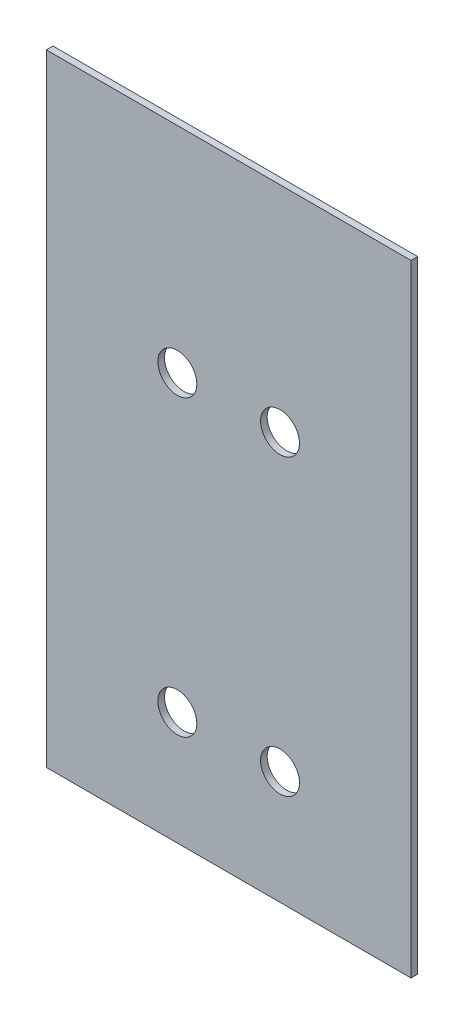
from build123d import *

# Parameters (mm, degrees)
SKETCH1_W                    = 469.9
SKETCH1_H                    = 1114.425
BOSS_EXTRUDE1_DEPTH          = 11.90625
F_2_CLEARANCE_HOLE1_D        = 69.85
SKETCH5_W                    = 184.15
SKETCH5_H                    = 1114.425
BOSS_EXTRUDE2_DEPTH          = 11.90625
F_9_32_2_75_DIAMETER_HOLE1_D = 69.85


with BuildPart() as part:
    # Sketch1 → Boss-Extrude1 (new body)
    with BuildSketch(Plane.XY):
        Rectangle(SKETCH1_W, SKETCH1_H)
    extrude(amount=BOSS_EXTRUDE1_DEPTH)

    # 2 Clearance Hole1 (through all)
    with Locations(Plane.XY.offset(11.90625)):
        with Locations((0, 173.0375), (0, -354.0125)):
            Hole(F_2_CLEARANCE_HOLE1_D / 2)

    # Sketch5 → Boss-Extrude2 (add)
    with BuildSketch(Plane.XY.offset(11.90625)):
        with Locations((327.025, 0)):
            Rectangle(SKETCH5_W, SKETCH5_H)
    extrude(amount=-BOSS_EXTRUDE2_DEPTH)

    # 9_32 _2.75_ Diameter Hole1 (through all)
    with Locations(Plane.XY.offset(11.90625)):
        with Locations((184.15, 173.0375), (184.15, -354.0125)):
            Hole(F_9_32_2_75_DIAMETER_HOLE1_D / 2)


solid = part.part
